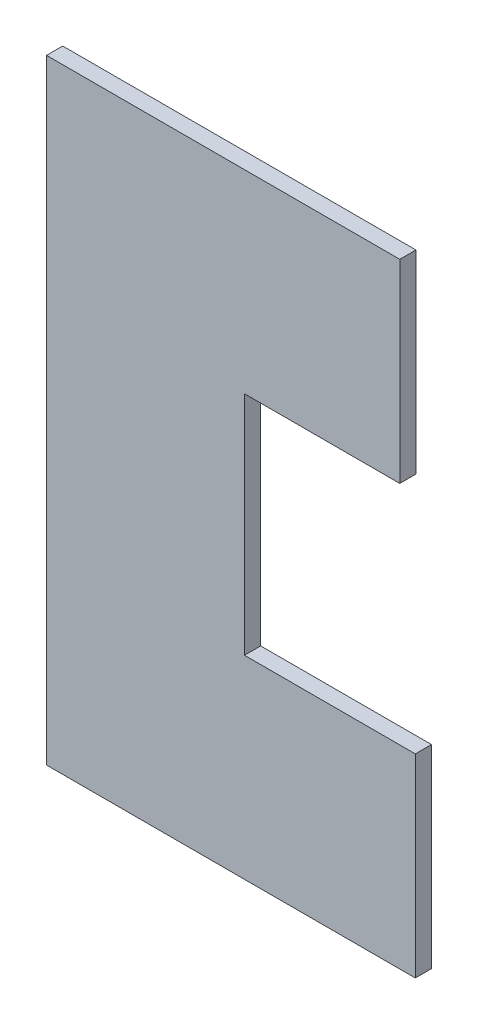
from build123d import *

# Parameters (mm, degrees)
EXTRUDE_1_DEPTH = 12.5


with BuildPart() as part:
    # Sketch 1 → Extrude 1 (new body)
    with BuildSketch(Plane.XY):
        Polygon((0, 0), (285, 0), (285, 150), (153, 150), (153, 325), (273, 325), (273, 475), (0, 475), align=None)
    extrude(amount=EXTRUDE_1_DEPTH)


solid = part.part
